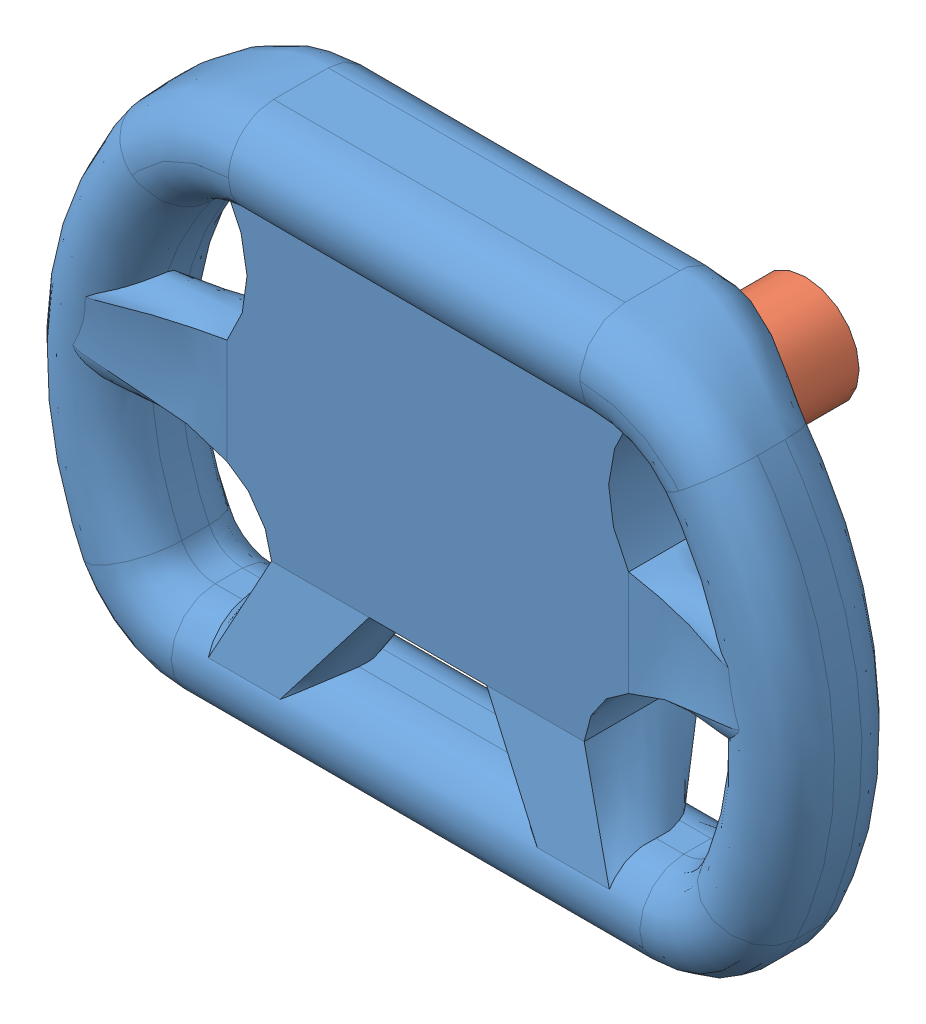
SolidWorks assembly Steering Wheel.SLDASM, configuration Default (file format 4400). Lengths in mm.
Overall size (250.72 174.65 131.11).
2 component instances, 2 part files, 3 mates.
Components (placement in the parent):
- Steering Wheel Mold - CF-1: Steering Wheel Mold - CF.SLDPRT [Default] at origin size (250.72 174.65 64.37)
- Steering Wheel Connector-1: Steering Wheel Connector.SLDPRT [Default] at (0 0 -55.0672) x (1 0 0) z (0 1 0) size (63.5 66.75 63.5)
Mates (geometry in assembly coordinates):
- Concentric18: concentric anti-aligned: circle of Steering Wheel Mold - CF-1; circle of Steering Wheel Connector-1
- Coincident70: coincident aligned: plane of Steering Wheel Connector-1; plane of assembly through (0 0 0) normal (1 0 0)
- Coincident71: coincident anti-aligned: plane of Steering Wheel Mold - CF-1 through (16.0923 18.9061 -45.974) normal (0 0 -1); plane of Steering Wheel Connector-1 through (0 -63.3339 -45.974) normal (0 0 1)
